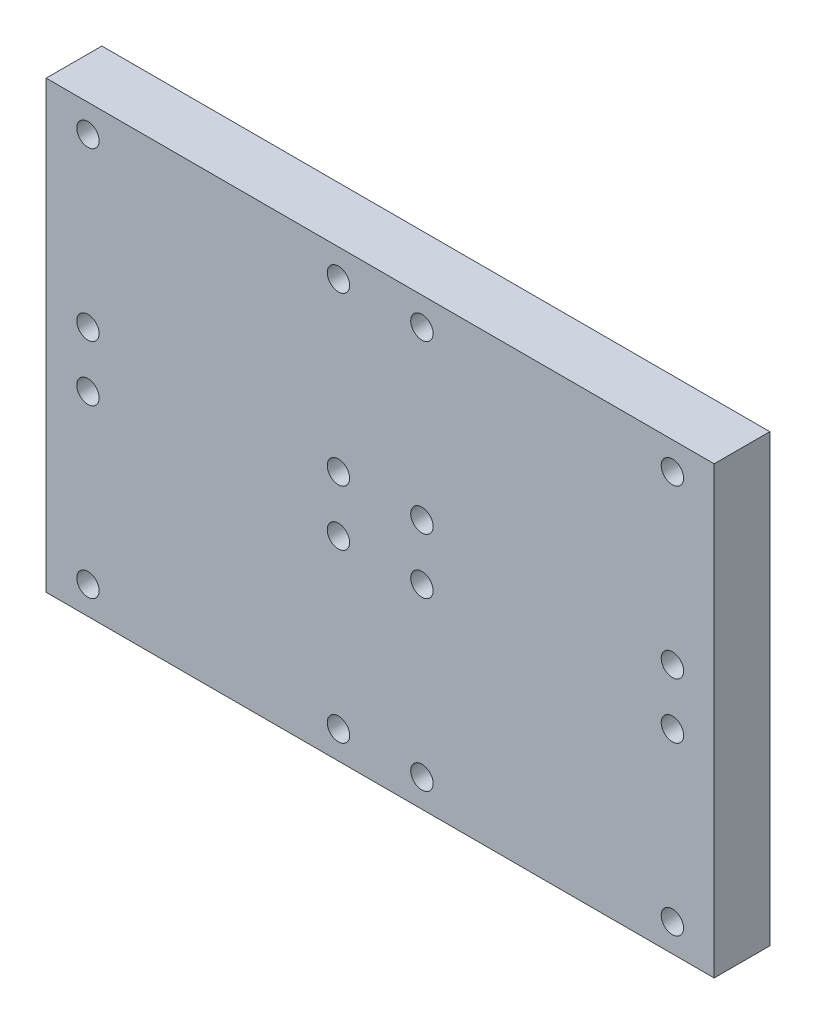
ISO-10303-21;
HEADER;
FILE_DESCRIPTION(('STEP AP214'),'2;1');
FILE_NAME('part.step','',(''),(''),'','','');
FILE_SCHEMA(('AUTOMOTIVE_DESIGN { 1 0 10303 214 1 1 1 1 }'));
ENDSEC;
DATA;
#1=APPLICATION_CONTEXT('core data for automotive mechanical design processes');
#2=APPLICATION_PROTOCOL_DEFINITION('international standard','automotive_design',2000,#1);
#3=PRODUCT_CONTEXT('',#1,'mechanical');
#4=PRODUCT('Part','Part','',(#3));
#5=PRODUCT_RELATED_PRODUCT_CATEGORY('part','',(#4));
#6=PRODUCT_DEFINITION_FORMATION('','',#4);
#7=PRODUCT_DEFINITION_CONTEXT('part definition',#1,'design');
#8=PRODUCT_DEFINITION('design','',#6,#7);
#9=PRODUCT_DEFINITION_SHAPE('','',#8);
#10=(LENGTH_UNIT() NAMED_UNIT(*) SI_UNIT(.MILLI.,.METRE.));
#11=(NAMED_UNIT(*) PLANE_ANGLE_UNIT() SI_UNIT($,.RADIAN.));
#12=(NAMED_UNIT(*) SI_UNIT($,.STERADIAN.) SOLID_ANGLE_UNIT());
#13=UNCERTAINTY_MEASURE_WITH_UNIT(LENGTH_MEASURE(1.E-05),#10,'distance_accuracy_value','');
#14=(GEOMETRIC_REPRESENTATION_CONTEXT(3) GLOBAL_UNCERTAINTY_ASSIGNED_CONTEXT((#13)) GLOBAL_UNIT_ASSIGNED_CONTEXT((#10,
#11,#12)) REPRESENTATION_CONTEXT('',''));
#15=CARTESIAN_POINT('',(0.,0.,0.));
#16=DIRECTION('',(0.,0.,1.));
#17=DIRECTION('',(1.,0.,0.));
#18=AXIS2_PLACEMENT_3D('',#15,#16,#17);
#19=CARTESIAN_POINT('',(0.,0.,12.7));
#20=DIRECTION('',(1.,0.,0.));
#21=DIRECTION('',(0.,0.,-1.));
#22=AXIS2_PLACEMENT_3D('',#19,#20,#21);
#23=PLANE('',#22);
#24=DIRECTION('',(0.,-1.,0.));
#25=VECTOR('',#24,1.);
#26=CARTESIAN_POINT('',(0.,0.,0.));
#27=LINE('',#26,#25);
#28=CARTESIAN_POINT('',(0.,101.6,0.));
#29=VERTEX_POINT('',#28);
#30=CARTESIAN_POINT('',(0.,0.,0.));
#31=VERTEX_POINT('',#30);
#32=EDGE_CURVE('E99',#29,#31,#27,.T.);
#33=ORIENTED_EDGE('',*,*,#32,.T.);
#34=DIRECTION('',(0.,0.,-1.));
#35=VECTOR('',#34,1.);
#36=CARTESIAN_POINT('',(0.,0.,12.7));
#37=LINE('',#36,#35);
#38=CARTESIAN_POINT('',(0.,0.,12.7));
#39=VERTEX_POINT('',#38);
#40=EDGE_CURVE('E90',#39,#31,#37,.T.);
#41=ORIENTED_EDGE('',*,*,#40,.F.);
#42=DIRECTION('',(0.,-1.,0.));
#43=VECTOR('',#42,1.);
#44=CARTESIAN_POINT('',(0.,0.,12.7));
#45=LINE('',#44,#43);
#46=CARTESIAN_POINT('',(0.,101.6,12.7));
#47=VERTEX_POINT('',#46);
#48=EDGE_CURVE('E84',#47,#39,#45,.T.);
#49=ORIENTED_EDGE('',*,*,#48,.F.);
#50=DIRECTION('',(0.,0.,-1.));
#51=VECTOR('',#50,1.);
#52=CARTESIAN_POINT('',(0.,101.6,12.7));
#53=LINE('',#52,#51);
#54=EDGE_CURVE('E95',#47,#29,#53,.T.);
#55=ORIENTED_EDGE('',*,*,#54,.T.);
#56=EDGE_LOOP('',(#33,#41,#49,#55));
#57=FACE_BOUND('',#56,.T.);
#58=ADVANCED_FACE('F30',(#57),#23,.F.);
#59=CARTESIAN_POINT('',(0.,0.,12.7));
#60=DIRECTION('',(0.,1.,0.));
#61=DIRECTION('',(0.,0.,1.));
#62=AXIS2_PLACEMENT_3D('',#59,#60,#61);
#63=PLANE('',#62);
#64=DIRECTION('',(1.,0.,0.));
#65=VECTOR('',#64,1.);
#66=CARTESIAN_POINT('',(0.,0.,0.));
#67=LINE('',#66,#65);
#68=CARTESIAN_POINT('',(152.4,0.,0.));
#69=VERTEX_POINT('',#68);
#70=EDGE_CURVE('E89',#31,#69,#67,.T.);
#71=ORIENTED_EDGE('',*,*,#70,.T.);
#72=DIRECTION('',(0.,0.,-1.));
#73=VECTOR('',#72,1.);
#74=CARTESIAN_POINT('',(152.4,0.,12.7));
#75=LINE('',#74,#73);
#76=CARTESIAN_POINT('',(152.4,0.,12.7));
#77=VERTEX_POINT('',#76);
#78=EDGE_CURVE('E87',#77,#69,#75,.T.);
#79=ORIENTED_EDGE('',*,*,#78,.F.);
#80=DIRECTION('',(1.,0.,0.));
#81=VECTOR('',#80,1.);
#82=CARTESIAN_POINT('',(0.,0.,12.7));
#83=LINE('',#82,#81);
#84=EDGE_CURVE('E78',#39,#77,#83,.T.);
#85=ORIENTED_EDGE('',*,*,#84,.F.);
#86=ORIENTED_EDGE('',*,*,#40,.T.);
#87=EDGE_LOOP('',(#71,#79,#85,#86));
#88=FACE_BOUND('',#87,.T.);
#89=ADVANCED_FACE('F88',(#88),#63,.F.);
#90=CARTESIAN_POINT('',(152.4,0.,12.7));
#91=DIRECTION('',(-1.,0.,0.));
#92=DIRECTION('',(0.,0.,1.));
#93=AXIS2_PLACEMENT_3D('',#90,#91,#92);
#94=PLANE('',#93);
#95=DIRECTION('',(0.,1.,0.));
#96=VECTOR('',#95,1.);
#97=CARTESIAN_POINT('',(152.4,0.,0.));
#98=LINE('',#97,#96);
#99=CARTESIAN_POINT('',(152.4,101.6,0.));
#100=VERTEX_POINT('',#99);
#101=EDGE_CURVE('E64',#69,#100,#98,.T.);
#102=ORIENTED_EDGE('',*,*,#101,.T.);
#103=DIRECTION('',(0.,0.,-1.));
#104=VECTOR('',#103,1.);
#105=CARTESIAN_POINT('',(152.4,101.6,12.7));
#106=LINE('',#105,#104);
#107=CARTESIAN_POINT('',(152.4,101.6,12.7));
#108=VERTEX_POINT('',#107);
#109=EDGE_CURVE('E91',#108,#100,#106,.T.);
#110=ORIENTED_EDGE('',*,*,#109,.F.);
#111=DIRECTION('',(0.,1.,0.));
#112=VECTOR('',#111,1.);
#113=CARTESIAN_POINT('',(152.4,0.,12.7));
#114=LINE('',#113,#112);
#115=EDGE_CURVE('E82',#77,#108,#114,.T.);
#116=ORIENTED_EDGE('',*,*,#115,.F.);
#117=ORIENTED_EDGE('',*,*,#78,.T.);
#118=EDGE_LOOP('',(#102,#110,#116,#117));
#119=FACE_BOUND('',#118,.T.);
#120=ADVANCED_FACE('F93',(#119),#94,.F.);
#121=CARTESIAN_POINT('',(0.,101.6,12.7));
#122=DIRECTION('',(0.,-1.,0.));
#123=DIRECTION('',(0.,0.,-1.));
#124=AXIS2_PLACEMENT_3D('',#121,#122,#123);
#125=PLANE('',#124);
#126=DIRECTION('',(-1.,0.,0.));
#127=VECTOR('',#126,1.);
#128=CARTESIAN_POINT('',(0.,101.6,0.));
#129=LINE('',#128,#127);
#130=EDGE_CURVE('E70',#100,#29,#129,.T.);
#131=ORIENTED_EDGE('',*,*,#130,.T.);
#132=ORIENTED_EDGE('',*,*,#54,.F.);
#133=DIRECTION('',(-1.,0.,0.));
#134=VECTOR('',#133,1.);
#135=CARTESIAN_POINT('',(0.,101.6,12.7));
#136=LINE('',#135,#134);
#137=EDGE_CURVE('E47',#108,#47,#136,.T.);
#138=ORIENTED_EDGE('',*,*,#137,.F.);
#139=ORIENTED_EDGE('',*,*,#109,.T.);
#140=EDGE_LOOP('',(#131,#132,#138,#139));
#141=FACE_BOUND('',#140,.T.);
#142=ADVANCED_FACE('F161',(#141),#125,.F.);
#143=CARTESIAN_POINT('',(0.,101.6,12.7));
#144=DIRECTION('',(0.,0.,-1.));
#145=DIRECTION('',(-1.,0.,0.));
#146=AXIS2_PLACEMENT_3D('',#143,#144,#145);
#147=PLANE('',#146);
#148=CARTESIAN_POINT('',(142.875,6.35000000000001,12.7));
#149=DIRECTION('',(0.,0.,1.));
#150=DIRECTION('',(1.,0.,0.));
#151=AXIS2_PLACEMENT_3D('',#148,#149,#150);
#152=CIRCLE('',#151,2.55269999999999);
#153=CARTESIAN_POINT('',(145.4277,6.35000000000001,12.7));
#154=VERTEX_POINT('',#153);
#155=EDGE_CURVE('E298',#154,#154,#152,.T.);
#156=ORIENTED_EDGE('',*,*,#155,.F.);
#157=EDGE_LOOP('',(#156));
#158=FACE_BOUND('',#157,.T.);
#159=CARTESIAN_POINT('',(142.875,44.45,12.7));
#160=DIRECTION('',(0.,0.,1.));
#161=DIRECTION('',(1.,0.,0.));
#162=AXIS2_PLACEMENT_3D('',#159,#160,#161);
#163=CIRCLE('',#162,2.55269999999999);
#164=CARTESIAN_POINT('',(145.4277,44.45,12.7));
#165=VERTEX_POINT('',#164);
#166=EDGE_CURVE('E292',#165,#165,#163,.T.);
#167=ORIENTED_EDGE('',*,*,#166,.F.);
#168=EDGE_LOOP('',(#167));
#169=FACE_BOUND('',#168,.T.);
#170=CARTESIAN_POINT('',(85.725,44.45,12.7));
#171=DIRECTION('',(0.,0.,1.));
#172=DIRECTION('',(1.,0.,0.));
#173=AXIS2_PLACEMENT_3D('',#170,#171,#172);
#174=CIRCLE('',#173,2.55269999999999);
#175=CARTESIAN_POINT('',(88.2777,44.45,12.7));
#176=VERTEX_POINT('',#175);
#177=EDGE_CURVE('E286',#176,#176,#174,.T.);
#178=ORIENTED_EDGE('',*,*,#177,.F.);
#179=EDGE_LOOP('',(#178));
#180=FACE_BOUND('',#179,.T.);
#181=CARTESIAN_POINT('',(85.725,6.35,12.7));
#182=DIRECTION('',(0.,0.,1.));
#183=DIRECTION('',(1.,0.,0.));
#184=AXIS2_PLACEMENT_3D('',#181,#182,#183);
#185=CIRCLE('',#184,2.55269999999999);
#186=CARTESIAN_POINT('',(88.2777,6.35,12.7));
#187=VERTEX_POINT('',#186);
#188=EDGE_CURVE('E280',#187,#187,#185,.T.);
#189=ORIENTED_EDGE('',*,*,#188,.F.);
#190=EDGE_LOOP('',(#189));
#191=FACE_BOUND('',#190,.T.);
#192=CARTESIAN_POINT('',(9.52500000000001,6.35,12.7));
#193=DIRECTION('',(0.,0.,1.));
#194=DIRECTION('',(1.,0.,0.));
#195=AXIS2_PLACEMENT_3D('',#192,#193,#194);
#196=CIRCLE('',#195,2.55269999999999);
#197=CARTESIAN_POINT('',(12.0777,6.35,12.7));
#198=VERTEX_POINT('',#197);
#199=EDGE_CURVE('E277',#198,#198,#196,.T.);
#200=ORIENTED_EDGE('',*,*,#199,.F.);
#201=EDGE_LOOP('',(#200));
#202=FACE_BOUND('',#201,.T.);
#203=CARTESIAN_POINT('',(66.675,6.35000000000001,12.7));
#204=DIRECTION('',(0.,0.,1.));
#205=DIRECTION('',(1.,0.,0.));
#206=AXIS2_PLACEMENT_3D('',#203,#204,#205);
#207=CIRCLE('',#206,2.55269999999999);
#208=CARTESIAN_POINT('',(69.2277,6.35000000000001,12.7));
#209=VERTEX_POINT('',#208);
#210=EDGE_CURVE('E271',#209,#209,#207,.T.);
#211=ORIENTED_EDGE('',*,*,#210,.F.);
#212=EDGE_LOOP('',(#211));
#213=FACE_BOUND('',#212,.T.);
#214=CARTESIAN_POINT('',(66.675,44.45,12.7));
#215=DIRECTION('',(0.,0.,1.));
#216=DIRECTION('',(1.,0.,0.));
#217=AXIS2_PLACEMENT_3D('',#214,#215,#216);
#218=CIRCLE('',#217,2.55269999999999);
#219=CARTESIAN_POINT('',(69.2277,44.45,12.7));
#220=VERTEX_POINT('',#219);
#221=EDGE_CURVE('E263',#220,#220,#218,.T.);
#222=ORIENTED_EDGE('',*,*,#221,.F.);
#223=EDGE_LOOP('',(#222));
#224=FACE_BOUND('',#223,.T.);
#225=CARTESIAN_POINT('',(9.52500000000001,44.45,12.7));
#226=DIRECTION('',(0.,0.,1.));
#227=DIRECTION('',(1.,0.,0.));
#228=AXIS2_PLACEMENT_3D('',#225,#226,#227);
#229=CIRCLE('',#228,2.55269999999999);
#230=CARTESIAN_POINT('',(12.0777,44.45,12.7));
#231=VERTEX_POINT('',#230);
#232=EDGE_CURVE('E257',#231,#231,#229,.T.);
#233=ORIENTED_EDGE('',*,*,#232,.F.);
#234=EDGE_LOOP('',(#233));
#235=FACE_BOUND('',#234,.T.);
#236=ORIENTED_EDGE('',*,*,#48,.T.);
#237=ORIENTED_EDGE('',*,*,#84,.T.);
#238=ORIENTED_EDGE('',*,*,#115,.T.);
#239=ORIENTED_EDGE('',*,*,#137,.T.);
#240=EDGE_LOOP('',(#236,#237,#238,#239));
#241=FACE_BOUND('',#240,.T.);
#242=CARTESIAN_POINT('',(9.52500000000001,57.15,12.7));
#243=DIRECTION('',(0.,0.,1.));
#244=DIRECTION('',(1.,0.,0.));
#245=AXIS2_PLACEMENT_3D('',#242,#243,#244);
#246=CIRCLE('',#245,2.55269999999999);
#247=CARTESIAN_POINT('',(12.0777,57.15,12.7));
#248=VERTEX_POINT('',#247);
#249=EDGE_CURVE('E112',#248,#248,#246,.T.);
#250=ORIENTED_EDGE('',*,*,#249,.F.);
#251=EDGE_LOOP('',(#250));
#252=FACE_BOUND('',#251,.T.);
#253=CARTESIAN_POINT('',(85.725,57.15,12.7));
#254=DIRECTION('',(0.,0.,1.));
#255=DIRECTION('',(1.,0.,0.));
#256=AXIS2_PLACEMENT_3D('',#253,#254,#255);
#257=CIRCLE('',#256,2.55269999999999);
#258=CARTESIAN_POINT('',(88.2777,57.15,12.7));
#259=VERTEX_POINT('',#258);
#260=EDGE_CURVE('E118',#259,#259,#257,.T.);
#261=ORIENTED_EDGE('',*,*,#260,.F.);
#262=EDGE_LOOP('',(#261));
#263=FACE_BOUND('',#262,.T.);
#264=CARTESIAN_POINT('',(9.52500000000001,95.25,12.7));
#265=DIRECTION('',(0.,0.,1.));
#266=DIRECTION('',(1.,0.,0.));
#267=AXIS2_PLACEMENT_3D('',#264,#265,#266);
#268=CIRCLE('',#267,2.55269999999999);
#269=CARTESIAN_POINT('',(12.0777,95.25,12.7));
#270=VERTEX_POINT('',#269);
#271=EDGE_CURVE('E124',#270,#270,#268,.T.);
#272=ORIENTED_EDGE('',*,*,#271,.F.);
#273=EDGE_LOOP('',(#272));
#274=FACE_BOUND('',#273,.T.);
#275=CARTESIAN_POINT('',(85.725,95.25,12.7));
#276=DIRECTION('',(0.,0.,1.));
#277=DIRECTION('',(1.,0.,0.));
#278=AXIS2_PLACEMENT_3D('',#275,#276,#277);
#279=CIRCLE('',#278,2.55269999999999);
#280=CARTESIAN_POINT('',(88.2777,95.25,12.7));
#281=VERTEX_POINT('',#280);
#282=EDGE_CURVE('E130',#281,#281,#279,.T.);
#283=ORIENTED_EDGE('',*,*,#282,.F.);
#284=EDGE_LOOP('',(#283));
#285=FACE_BOUND('',#284,.T.);
#286=CARTESIAN_POINT('',(66.675,95.25,12.7));
#287=DIRECTION('',(0.,0.,1.));
#288=DIRECTION('',(1.,0.,0.));
#289=AXIS2_PLACEMENT_3D('',#286,#287,#288);
#290=CIRCLE('',#289,2.55269999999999);
#291=CARTESIAN_POINT('',(69.2277,95.25,12.7));
#292=VERTEX_POINT('',#291);
#293=EDGE_CURVE('E136',#292,#292,#290,.T.);
#294=ORIENTED_EDGE('',*,*,#293,.F.);
#295=EDGE_LOOP('',(#294));
#296=FACE_BOUND('',#295,.T.);
#297=CARTESIAN_POINT('',(142.875,95.25,12.7));
#298=DIRECTION('',(0.,0.,1.));
#299=DIRECTION('',(1.,0.,0.));
#300=AXIS2_PLACEMENT_3D('',#297,#298,#299);
#301=CIRCLE('',#300,2.55269999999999);
#302=CARTESIAN_POINT('',(145.4277,95.25,12.7));
#303=VERTEX_POINT('',#302);
#304=EDGE_CURVE('E142',#303,#303,#301,.T.);
#305=ORIENTED_EDGE('',*,*,#304,.F.);
#306=EDGE_LOOP('',(#305));
#307=FACE_BOUND('',#306,.T.);
#308=CARTESIAN_POINT('',(66.675,57.15,12.7));
#309=DIRECTION('',(0.,0.,1.));
#310=DIRECTION('',(1.,0.,0.));
#311=AXIS2_PLACEMENT_3D('',#308,#309,#310);
#312=CIRCLE('',#311,2.55269999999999);
#313=CARTESIAN_POINT('',(69.2277,57.15,12.7));
#314=VERTEX_POINT('',#313);
#315=EDGE_CURVE('E148',#314,#314,#312,.T.);
#316=ORIENTED_EDGE('',*,*,#315,.F.);
#317=EDGE_LOOP('',(#316));
#318=FACE_BOUND('',#317,.T.);
#319=CARTESIAN_POINT('',(142.875,57.15,12.7));
#320=DIRECTION('',(0.,0.,1.));
#321=DIRECTION('',(1.,0.,0.));
#322=AXIS2_PLACEMENT_3D('',#319,#320,#321);
#323=CIRCLE('',#322,2.55269999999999);
#324=CARTESIAN_POINT('',(145.4277,57.15,12.7));
#325=VERTEX_POINT('',#324);
#326=EDGE_CURVE('E11',#325,#325,#323,.T.);
#327=ORIENTED_EDGE('',*,*,#326,.F.);
#328=EDGE_LOOP('',(#327));
#329=FACE_BOUND('',#328,.T.);
#330=ADVANCED_FACE('F79',(#158,#169,#180,#191,#202,#213,#224,#235,#241,#252,#263,#274,#285,#296,
#307,#318,#329),#147,.F.);
#331=CARTESIAN_POINT('',(0.,101.6,0.));
#332=DIRECTION('',(0.,0.,-1.));
#333=DIRECTION('',(-1.,0.,0.));
#334=AXIS2_PLACEMENT_3D('',#331,#332,#333);
#335=PLANE('',#334);
#336=CARTESIAN_POINT('',(142.875,6.35000000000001,0.));
#337=DIRECTION('',(0.,0.,1.));
#338=DIRECTION('',(1.,0.,0.));
#339=AXIS2_PLACEMENT_3D('',#336,#337,#338);
#340=CIRCLE('',#339,2.55269999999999);
#341=CARTESIAN_POINT('',(145.4277,6.35000000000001,0.));
#342=VERTEX_POINT('',#341);
#343=EDGE_CURVE('E301',#342,#342,#340,.T.);
#344=ORIENTED_EDGE('',*,*,#343,.T.);
#345=EDGE_LOOP('',(#344));
#346=FACE_BOUND('',#345,.T.);
#347=CARTESIAN_POINT('',(142.875,44.45,0.));
#348=DIRECTION('',(0.,0.,1.));
#349=DIRECTION('',(1.,0.,0.));
#350=AXIS2_PLACEMENT_3D('',#347,#348,#349);
#351=CIRCLE('',#350,2.55269999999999);
#352=CARTESIAN_POINT('',(145.4277,44.45,0.));
#353=VERTEX_POINT('',#352);
#354=EDGE_CURVE('E295',#353,#353,#351,.T.);
#355=ORIENTED_EDGE('',*,*,#354,.T.);
#356=EDGE_LOOP('',(#355));
#357=FACE_BOUND('',#356,.T.);
#358=CARTESIAN_POINT('',(85.725,44.45,0.));
#359=DIRECTION('',(0.,0.,1.));
#360=DIRECTION('',(1.,0.,0.));
#361=AXIS2_PLACEMENT_3D('',#358,#359,#360);
#362=CIRCLE('',#361,2.5527);
#363=CARTESIAN_POINT('',(88.2777,44.45,0.));
#364=VERTEX_POINT('',#363);
#365=EDGE_CURVE('E289',#364,#364,#362,.T.);
#366=ORIENTED_EDGE('',*,*,#365,.T.);
#367=EDGE_LOOP('',(#366));
#368=FACE_BOUND('',#367,.T.);
#369=CARTESIAN_POINT('',(85.725,6.35,0.));
#370=DIRECTION('',(0.,0.,1.));
#371=DIRECTION('',(1.,0.,0.));
#372=AXIS2_PLACEMENT_3D('',#369,#370,#371);
#373=CIRCLE('',#372,2.5527);
#374=CARTESIAN_POINT('',(88.2777,6.35,0.));
#375=VERTEX_POINT('',#374);
#376=EDGE_CURVE('E283',#375,#375,#373,.T.);
#377=ORIENTED_EDGE('',*,*,#376,.T.);
#378=EDGE_LOOP('',(#377));
#379=FACE_BOUND('',#378,.T.);
#380=CARTESIAN_POINT('',(9.52500000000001,6.35,0.));
#381=DIRECTION('',(0.,0.,1.));
#382=DIRECTION('',(1.,0.,0.));
#383=AXIS2_PLACEMENT_3D('',#380,#381,#382);
#384=CIRCLE('',#383,2.5527);
#385=CARTESIAN_POINT('',(12.0777,6.35,0.));
#386=VERTEX_POINT('',#385);
#387=EDGE_CURVE('E274',#386,#386,#384,.T.);
#388=ORIENTED_EDGE('',*,*,#387,.T.);
#389=EDGE_LOOP('',(#388));
#390=FACE_BOUND('',#389,.T.);
#391=CARTESIAN_POINT('',(66.675,6.35000000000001,0.));
#392=DIRECTION('',(0.,0.,1.));
#393=DIRECTION('',(1.,0.,0.));
#394=AXIS2_PLACEMENT_3D('',#391,#392,#393);
#395=CIRCLE('',#394,2.55269999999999);
#396=CARTESIAN_POINT('',(69.2277,6.35000000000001,0.));
#397=VERTEX_POINT('',#396);
#398=EDGE_CURVE('E268',#397,#397,#395,.T.);
#399=ORIENTED_EDGE('',*,*,#398,.T.);
#400=EDGE_LOOP('',(#399));
#401=FACE_BOUND('',#400,.T.);
#402=CARTESIAN_POINT('',(66.675,44.45,0.));
#403=DIRECTION('',(0.,0.,1.));
#404=DIRECTION('',(1.,0.,0.));
#405=AXIS2_PLACEMENT_3D('',#402,#403,#404);
#406=CIRCLE('',#405,2.55269999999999);
#407=CARTESIAN_POINT('',(69.2277,44.45,0.));
#408=VERTEX_POINT('',#407);
#409=EDGE_CURVE('E259',#408,#408,#406,.T.);
#410=ORIENTED_EDGE('',*,*,#409,.T.);
#411=EDGE_LOOP('',(#410));
#412=FACE_BOUND('',#411,.T.);
#413=CARTESIAN_POINT('',(9.52500000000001,44.45,0.));
#414=DIRECTION('',(0.,0.,1.));
#415=DIRECTION('',(1.,0.,0.));
#416=AXIS2_PLACEMENT_3D('',#413,#414,#415);
#417=CIRCLE('',#416,2.5527);
#418=CARTESIAN_POINT('',(12.0777,44.45,0.));
#419=VERTEX_POINT('',#418);
#420=EDGE_CURVE('E102',#419,#419,#417,.T.);
#421=ORIENTED_EDGE('',*,*,#420,.T.);
#422=EDGE_LOOP('',(#421));
#423=FACE_BOUND('',#422,.T.);
#424=ORIENTED_EDGE('',*,*,#32,.F.);
#425=ORIENTED_EDGE('',*,*,#130,.F.);
#426=ORIENTED_EDGE('',*,*,#101,.F.);
#427=ORIENTED_EDGE('',*,*,#70,.F.);
#428=EDGE_LOOP('',(#424,#425,#426,#427));
#429=FACE_BOUND('',#428,.T.);
#430=CARTESIAN_POINT('',(9.52500000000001,57.15,0.));
#431=DIRECTION('',(0.,0.,1.));
#432=DIRECTION('',(1.,0.,0.));
#433=AXIS2_PLACEMENT_3D('',#430,#431,#432);
#434=CIRCLE('',#433,2.5527);
#435=CARTESIAN_POINT('',(12.0777,57.15,0.));
#436=VERTEX_POINT('',#435);
#437=EDGE_CURVE('E109',#436,#436,#434,.T.);
#438=ORIENTED_EDGE('',*,*,#437,.T.);
#439=EDGE_LOOP('',(#438));
#440=FACE_BOUND('',#439,.T.);
#441=CARTESIAN_POINT('',(85.725,57.15,0.));
#442=DIRECTION('',(0.,0.,1.));
#443=DIRECTION('',(1.,0.,0.));
#444=AXIS2_PLACEMENT_3D('',#441,#442,#443);
#445=CIRCLE('',#444,2.5527);
#446=CARTESIAN_POINT('',(88.2777,57.15,0.));
#447=VERTEX_POINT('',#446);
#448=EDGE_CURVE('E115',#447,#447,#445,.T.);
#449=ORIENTED_EDGE('',*,*,#448,.T.);
#450=EDGE_LOOP('',(#449));
#451=FACE_BOUND('',#450,.T.);
#452=CARTESIAN_POINT('',(9.52500000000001,95.25,0.));
#453=DIRECTION('',(0.,0.,1.));
#454=DIRECTION('',(1.,0.,0.));
#455=AXIS2_PLACEMENT_3D('',#452,#453,#454);
#456=CIRCLE('',#455,2.5527);
#457=CARTESIAN_POINT('',(12.0777,95.25,0.));
#458=VERTEX_POINT('',#457);
#459=EDGE_CURVE('E121',#458,#458,#456,.T.);
#460=ORIENTED_EDGE('',*,*,#459,.T.);
#461=EDGE_LOOP('',(#460));
#462=FACE_BOUND('',#461,.T.);
#463=CARTESIAN_POINT('',(85.725,95.25,0.));
#464=DIRECTION('',(0.,0.,1.));
#465=DIRECTION('',(1.,0.,0.));
#466=AXIS2_PLACEMENT_3D('',#463,#464,#465);
#467=CIRCLE('',#466,2.5527);
#468=CARTESIAN_POINT('',(88.2777,95.25,0.));
#469=VERTEX_POINT('',#468);
#470=EDGE_CURVE('E127',#469,#469,#467,.T.);
#471=ORIENTED_EDGE('',*,*,#470,.T.);
#472=EDGE_LOOP('',(#471));
#473=FACE_BOUND('',#472,.T.);
#474=CARTESIAN_POINT('',(66.675,95.25,0.));
#475=DIRECTION('',(0.,0.,1.));
#476=DIRECTION('',(1.,0.,0.));
#477=AXIS2_PLACEMENT_3D('',#474,#475,#476);
#478=CIRCLE('',#477,2.55269999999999);
#479=CARTESIAN_POINT('',(69.2277,95.25,0.));
#480=VERTEX_POINT('',#479);
#481=EDGE_CURVE('E133',#480,#480,#478,.T.);
#482=ORIENTED_EDGE('',*,*,#481,.T.);
#483=EDGE_LOOP('',(#482));
#484=FACE_BOUND('',#483,.T.);
#485=CARTESIAN_POINT('',(142.875,95.25,0.));
#486=DIRECTION('',(0.,0.,1.));
#487=DIRECTION('',(1.,0.,0.));
#488=AXIS2_PLACEMENT_3D('',#485,#486,#487);
#489=CIRCLE('',#488,2.55269999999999);
#490=CARTESIAN_POINT('',(145.4277,95.25,0.));
#491=VERTEX_POINT('',#490);
#492=EDGE_CURVE('E139',#491,#491,#489,.T.);
#493=ORIENTED_EDGE('',*,*,#492,.T.);
#494=EDGE_LOOP('',(#493));
#495=FACE_BOUND('',#494,.T.);
#496=CARTESIAN_POINT('',(66.675,57.15,0.));
#497=DIRECTION('',(0.,0.,1.));
#498=DIRECTION('',(1.,0.,0.));
#499=AXIS2_PLACEMENT_3D('',#496,#497,#498);
#500=CIRCLE('',#499,2.55269999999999);
#501=CARTESIAN_POINT('',(69.2277,57.15,0.));
#502=VERTEX_POINT('',#501);
#503=EDGE_CURVE('E145',#502,#502,#500,.T.);
#504=ORIENTED_EDGE('',*,*,#503,.T.);
#505=EDGE_LOOP('',(#504));
#506=FACE_BOUND('',#505,.T.);
#507=CARTESIAN_POINT('',(142.875,57.15,0.));
#508=DIRECTION('',(0.,0.,1.));
#509=DIRECTION('',(1.,0.,0.));
#510=AXIS2_PLACEMENT_3D('',#507,#508,#509);
#511=CIRCLE('',#510,2.55269999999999);
#512=CARTESIAN_POINT('',(145.4277,57.15,0.));
#513=VERTEX_POINT('',#512);
#514=EDGE_CURVE('E39',#513,#513,#511,.T.);
#515=ORIENTED_EDGE('',*,*,#514,.T.);
#516=EDGE_LOOP('',(#515));
#517=FACE_BOUND('',#516,.T.);
#518=ADVANCED_FACE('F153',(#346,#357,#368,#379,#390,#401,#412,#423,#429,#440,#451,#462,#473,
#484,#495,#506,#517),#335,.T.);
#519=CARTESIAN_POINT('',(9.52500000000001,44.45,12.7));
#520=DIRECTION('',(0.,0.,1.));
#521=DIRECTION('',(1.,0.,0.));
#522=AXIS2_PLACEMENT_3D('',#519,#520,#521);
#523=CYLINDRICAL_SURFACE('',#522,2.55269999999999);
#524=ORIENTED_EDGE('',*,*,#420,.F.);
#525=EDGE_LOOP('',(#524));
#526=FACE_BOUND('',#525,.T.);
#527=ORIENTED_EDGE('',*,*,#232,.T.);
#528=EDGE_LOOP('',(#527));
#529=FACE_BOUND('',#528,.T.);
#530=ADVANCED_FACE('F168',(#526,#529),#523,.F.);
#531=CARTESIAN_POINT('',(66.675,44.45,12.7));
#532=DIRECTION('',(0.,0.,1.));
#533=DIRECTION('',(1.,0.,0.));
#534=AXIS2_PLACEMENT_3D('',#531,#532,#533);
#535=CYLINDRICAL_SURFACE('',#534,2.55269999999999);
#536=ORIENTED_EDGE('',*,*,#409,.F.);
#537=EDGE_LOOP('',(#536));
#538=FACE_BOUND('',#537,.T.);
#539=ORIENTED_EDGE('',*,*,#221,.T.);
#540=EDGE_LOOP('',(#539));
#541=FACE_BOUND('',#540,.T.);
#542=ADVANCED_FACE('F244',(#538,#541),#535,.F.);
#543=CARTESIAN_POINT('',(66.675,6.35000000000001,12.7));
#544=DIRECTION('',(0.,0.,1.));
#545=DIRECTION('',(1.,0.,0.));
#546=AXIS2_PLACEMENT_3D('',#543,#544,#545);
#547=CYLINDRICAL_SURFACE('',#546,2.55269999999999);
#548=ORIENTED_EDGE('',*,*,#398,.F.);
#549=EDGE_LOOP('',(#548));
#550=FACE_BOUND('',#549,.T.);
#551=ORIENTED_EDGE('',*,*,#210,.T.);
#552=EDGE_LOOP('',(#551));
#553=FACE_BOUND('',#552,.T.);
#554=ADVANCED_FACE('F240',(#550,#553),#547,.F.);
#555=CARTESIAN_POINT('',(9.52500000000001,6.35,12.7));
#556=DIRECTION('',(0.,0.,1.));
#557=DIRECTION('',(1.,0.,0.));
#558=AXIS2_PLACEMENT_3D('',#555,#556,#557);
#559=CYLINDRICAL_SURFACE('',#558,2.55269999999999);
#560=ORIENTED_EDGE('',*,*,#387,.F.);
#561=EDGE_LOOP('',(#560));
#562=FACE_BOUND('',#561,.T.);
#563=ORIENTED_EDGE('',*,*,#199,.T.);
#564=EDGE_LOOP('',(#563));
#565=FACE_BOUND('',#564,.T.);
#566=ADVANCED_FACE('F236',(#562,#565),#559,.F.);
#567=CARTESIAN_POINT('',(85.725,6.35,12.7));
#568=DIRECTION('',(0.,0.,1.));
#569=DIRECTION('',(1.,0.,0.));
#570=AXIS2_PLACEMENT_3D('',#567,#568,#569);
#571=CYLINDRICAL_SURFACE('',#570,2.55269999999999);
#572=ORIENTED_EDGE('',*,*,#376,.F.);
#573=EDGE_LOOP('',(#572));
#574=FACE_BOUND('',#573,.T.);
#575=ORIENTED_EDGE('',*,*,#188,.T.);
#576=EDGE_LOOP('',(#575));
#577=FACE_BOUND('',#576,.T.);
#578=ADVANCED_FACE('F188',(#574,#577),#571,.F.);
#579=CARTESIAN_POINT('',(9.52500000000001,57.15,12.7));
#580=DIRECTION('',(0.,0.,1.));
#581=DIRECTION('',(1.,0.,0.));
#582=AXIS2_PLACEMENT_3D('',#579,#580,#581);
#583=CYLINDRICAL_SURFACE('',#582,2.55269999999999);
#584=ORIENTED_EDGE('',*,*,#437,.F.);
#585=EDGE_LOOP('',(#584));
#586=FACE_BOUND('',#585,.T.);
#587=ORIENTED_EDGE('',*,*,#249,.T.);
#588=EDGE_LOOP('',(#587));
#589=FACE_BOUND('',#588,.T.);
#590=ADVANCED_FACE('F184',(#586,#589),#583,.F.);
#591=CARTESIAN_POINT('',(85.725,57.15,12.7));
#592=DIRECTION('',(0.,0.,1.));
#593=DIRECTION('',(1.,0.,0.));
#594=AXIS2_PLACEMENT_3D('',#591,#592,#593);
#595=CYLINDRICAL_SURFACE('',#594,2.55269999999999);
#596=ORIENTED_EDGE('',*,*,#448,.F.);
#597=EDGE_LOOP('',(#596));
#598=FACE_BOUND('',#597,.T.);
#599=ORIENTED_EDGE('',*,*,#260,.T.);
#600=EDGE_LOOP('',(#599));
#601=FACE_BOUND('',#600,.T.);
#602=ADVANCED_FACE('F187',(#598,#601),#595,.F.);
#603=CARTESIAN_POINT('',(85.725,44.45,12.7));
#604=DIRECTION('',(0.,0.,1.));
#605=DIRECTION('',(1.,0.,0.));
#606=AXIS2_PLACEMENT_3D('',#603,#604,#605);
#607=CYLINDRICAL_SURFACE('',#606,2.55269999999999);
#608=ORIENTED_EDGE('',*,*,#365,.F.);
#609=EDGE_LOOP('',(#608));
#610=FACE_BOUND('',#609,.T.);
#611=ORIENTED_EDGE('',*,*,#177,.T.);
#612=EDGE_LOOP('',(#611));
#613=FACE_BOUND('',#612,.T.);
#614=ADVANCED_FACE('F192',(#610,#613),#607,.F.);
#615=CARTESIAN_POINT('',(9.52500000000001,95.25,12.7));
#616=DIRECTION('',(0.,0.,1.));
#617=DIRECTION('',(1.,0.,0.));
#618=AXIS2_PLACEMENT_3D('',#615,#616,#617);
#619=CYLINDRICAL_SURFACE('',#618,2.55269999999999);
#620=ORIENTED_EDGE('',*,*,#459,.F.);
#621=EDGE_LOOP('',(#620));
#622=FACE_BOUND('',#621,.T.);
#623=ORIENTED_EDGE('',*,*,#271,.T.);
#624=EDGE_LOOP('',(#623));
#625=FACE_BOUND('',#624,.T.);
#626=ADVANCED_FACE('F194',(#622,#625),#619,.F.);
#627=CARTESIAN_POINT('',(85.725,95.25,12.7));
#628=DIRECTION('',(0.,0.,1.));
#629=DIRECTION('',(1.,0.,0.));
#630=AXIS2_PLACEMENT_3D('',#627,#628,#629);
#631=CYLINDRICAL_SURFACE('',#630,2.55269999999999);
#632=ORIENTED_EDGE('',*,*,#470,.F.);
#633=EDGE_LOOP('',(#632));
#634=FACE_BOUND('',#633,.T.);
#635=ORIENTED_EDGE('',*,*,#282,.T.);
#636=EDGE_LOOP('',(#635));
#637=FACE_BOUND('',#636,.T.);
#638=ADVANCED_FACE('F197',(#634,#637),#631,.F.);
#639=CARTESIAN_POINT('',(142.875,44.45,12.7));
#640=DIRECTION('',(0.,0.,1.));
#641=DIRECTION('',(1.,0.,0.));
#642=AXIS2_PLACEMENT_3D('',#639,#640,#641);
#643=CYLINDRICAL_SURFACE('',#642,2.55269999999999);
#644=ORIENTED_EDGE('',*,*,#354,.F.);
#645=EDGE_LOOP('',(#644));
#646=FACE_BOUND('',#645,.T.);
#647=ORIENTED_EDGE('',*,*,#166,.T.);
#648=EDGE_LOOP('',(#647));
#649=FACE_BOUND('',#648,.T.);
#650=ADVANCED_FACE('F201',(#646,#649),#643,.F.);
#651=CARTESIAN_POINT('',(66.675,95.25,12.7));
#652=DIRECTION('',(0.,0.,1.));
#653=DIRECTION('',(1.,0.,0.));
#654=AXIS2_PLACEMENT_3D('',#651,#652,#653);
#655=CYLINDRICAL_SURFACE('',#654,2.55269999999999);
#656=ORIENTED_EDGE('',*,*,#481,.F.);
#657=EDGE_LOOP('',(#656));
#658=FACE_BOUND('',#657,.T.);
#659=ORIENTED_EDGE('',*,*,#293,.T.);
#660=EDGE_LOOP('',(#659));
#661=FACE_BOUND('',#660,.T.);
#662=ADVANCED_FACE('F203',(#658,#661),#655,.F.);
#663=CARTESIAN_POINT('',(142.875,95.25,12.7));
#664=DIRECTION('',(0.,0.,1.));
#665=DIRECTION('',(1.,0.,0.));
#666=AXIS2_PLACEMENT_3D('',#663,#664,#665);
#667=CYLINDRICAL_SURFACE('',#666,2.55269999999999);
#668=ORIENTED_EDGE('',*,*,#492,.F.);
#669=EDGE_LOOP('',(#668));
#670=FACE_BOUND('',#669,.T.);
#671=ORIENTED_EDGE('',*,*,#304,.T.);
#672=EDGE_LOOP('',(#671));
#673=FACE_BOUND('',#672,.T.);
#674=ADVANCED_FACE('F206',(#670,#673),#667,.F.);
#675=CARTESIAN_POINT('',(142.875,6.35000000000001,12.7));
#676=DIRECTION('',(0.,0.,1.));
#677=DIRECTION('',(1.,0.,0.));
#678=AXIS2_PLACEMENT_3D('',#675,#676,#677);
#679=CYLINDRICAL_SURFACE('',#678,2.55269999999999);
#680=ORIENTED_EDGE('',*,*,#343,.F.);
#681=EDGE_LOOP('',(#680));
#682=FACE_BOUND('',#681,.T.);
#683=ORIENTED_EDGE('',*,*,#155,.T.);
#684=EDGE_LOOP('',(#683));
#685=FACE_BOUND('',#684,.T.);
#686=ADVANCED_FACE('F209',(#682,#685),#679,.F.);
#687=CARTESIAN_POINT('',(66.675,57.15,12.7));
#688=DIRECTION('',(0.,0.,1.));
#689=DIRECTION('',(1.,0.,0.));
#690=AXIS2_PLACEMENT_3D('',#687,#688,#689);
#691=CYLINDRICAL_SURFACE('',#690,2.55269999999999);
#692=ORIENTED_EDGE('',*,*,#503,.F.);
#693=EDGE_LOOP('',(#692));
#694=FACE_BOUND('',#693,.T.);
#695=ORIENTED_EDGE('',*,*,#315,.T.);
#696=EDGE_LOOP('',(#695));
#697=FACE_BOUND('',#696,.T.);
#698=ADVANCED_FACE('F157',(#694,#697),#691,.F.);
#699=CARTESIAN_POINT('',(142.875,57.15,12.7));
#700=DIRECTION('',(0.,0.,1.));
#701=DIRECTION('',(1.,0.,0.));
#702=AXIS2_PLACEMENT_3D('',#699,#700,#701);
#703=CYLINDRICAL_SURFACE('',#702,2.55269999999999);
#704=ORIENTED_EDGE('',*,*,#514,.F.);
#705=EDGE_LOOP('',(#704));
#706=FACE_BOUND('',#705,.T.);
#707=ORIENTED_EDGE('',*,*,#326,.T.);
#708=EDGE_LOOP('',(#707));
#709=FACE_BOUND('',#708,.T.);
#710=ADVANCED_FACE('F32',(#706,#709),#703,.F.);
#711=CLOSED_SHELL('',(#58,#89,#120,#142,#330,#518,#530,#542,#554,#566,#578,#590,#602,#614,#626,
#638,#650,#662,#674,#686,#698,#710));
#712=MANIFOLD_SOLID_BREP('B2',#711);
#713=ADVANCED_BREP_SHAPE_REPRESENTATION('',(#18,#712),#14);
#714=SHAPE_DEFINITION_REPRESENTATION(#9,#713);
ENDSEC;
END-ISO-10303-21;
